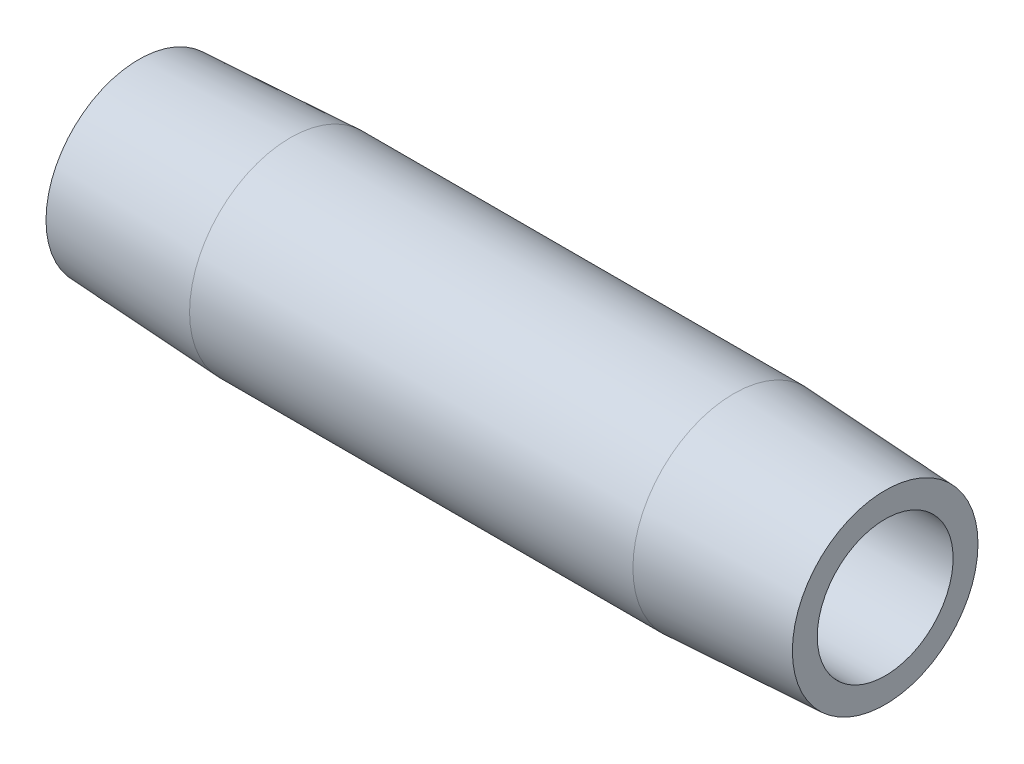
ISO-10303-21;
HEADER;
FILE_DESCRIPTION(('STEP AP214'),'2;1');
FILE_NAME('part.step','',(''),(''),'','','');
FILE_SCHEMA(('AUTOMOTIVE_DESIGN { 1 0 10303 214 1 1 1 1 }'));
ENDSEC;
DATA;
#1=APPLICATION_CONTEXT('core data for automotive mechanical design processes');
#2=APPLICATION_PROTOCOL_DEFINITION('international standard','automotive_design',2000,#1);
#3=PRODUCT_CONTEXT('',#1,'mechanical');
#4=PRODUCT('Part','Part','',(#3));
#5=PRODUCT_RELATED_PRODUCT_CATEGORY('part','',(#4));
#6=PRODUCT_DEFINITION_FORMATION('','',#4);
#7=PRODUCT_DEFINITION_CONTEXT('part definition',#1,'design');
#8=PRODUCT_DEFINITION('design','',#6,#7);
#9=PRODUCT_DEFINITION_SHAPE('','',#8);
#10=(LENGTH_UNIT() NAMED_UNIT(*) SI_UNIT(.MILLI.,.METRE.));
#11=(NAMED_UNIT(*) PLANE_ANGLE_UNIT() SI_UNIT($,.RADIAN.));
#12=(NAMED_UNIT(*) SI_UNIT($,.STERADIAN.) SOLID_ANGLE_UNIT());
#13=UNCERTAINTY_MEASURE_WITH_UNIT(LENGTH_MEASURE(1.E-05),#10,'distance_accuracy_value','');
#14=(GEOMETRIC_REPRESENTATION_CONTEXT(3) GLOBAL_UNCERTAINTY_ASSIGNED_CONTEXT((#13)) GLOBAL_UNIT_ASSIGNED_CONTEXT((#10,
#11,#12)) REPRESENTATION_CONTEXT('',''));
#15=CARTESIAN_POINT('',(0.,0.,0.));
#16=DIRECTION('',(0.,0.,1.));
#17=DIRECTION('',(1.,0.,0.));
#18=AXIS2_PLACEMENT_3D('',#15,#16,#17);
#19=CARTESIAN_POINT('',(50.8000000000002,0.,-4.62277681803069));
#20=DIRECTION('',(-1.,0.,0.));
#21=DIRECTION('',(0.,0.,1.));
#22=AXIS2_PLACEMENT_3D('',#19,#20,#21);
#23=PLANE('',#22);
#24=CARTESIAN_POINT('',(50.8000000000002,0.,0.));
#25=DIRECTION('',(-1.,0.,0.));
#26=DIRECTION('',(0.,0.,1.));
#27=AXIS2_PLACEMENT_3D('',#24,#25,#26);
#28=CIRCLE('',#27,6.31752683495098);
#29=CARTESIAN_POINT('',(50.8000000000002,0.,6.31752683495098));
#30=VERTEX_POINT('',#29);
#31=EDGE_CURVE('E10',#30,#30,#28,.T.);
#32=ORIENTED_EDGE('',*,*,#31,.F.);
#33=EDGE_LOOP('',(#32));
#34=FACE_BOUND('',#33,.T.);
#35=CARTESIAN_POINT('',(50.8000000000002,0.,0.));
#36=DIRECTION('',(-1.,0.,0.));
#37=DIRECTION('',(0.,0.,1.));
#38=AXIS2_PLACEMENT_3D('',#35,#36,#37);
#39=CIRCLE('',#38,4.62277681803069);
#40=CARTESIAN_POINT('',(50.8000000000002,0.,4.62277681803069));
#41=VERTEX_POINT('',#40);
#42=EDGE_CURVE('E52',#41,#41,#39,.T.);
#43=ORIENTED_EDGE('',*,*,#42,.T.);
#44=EDGE_LOOP('',(#43));
#45=FACE_BOUND('',#44,.T.);
#46=ADVANCED_FACE('F30',(#34,#45),#23,.F.);
#47=CARTESIAN_POINT('',(50.8000000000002,0.,0.));
#48=DIRECTION('',(-1.,0.,0.));
#49=DIRECTION('',(0.,0.,1.));
#50=AXIS2_PLACEMENT_3D('',#47,#48,#49);
#51=CONICAL_SURFACE('',#50,6.31752683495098,0.0523598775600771);
#52=CARTESIAN_POINT('',(40.4876000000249,0.,0.));
#53=DIRECTION('',(-1.,0.,0.));
#54=DIRECTION('',(0.,0.,1.));
#55=AXIS2_PLACEMENT_3D('',#52,#53,#54);
#56=CIRCLE('',#55,6.85797681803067);
#57=CARTESIAN_POINT('',(40.4876000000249,0.,6.85797681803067));
#58=VERTEX_POINT('',#57);
#59=EDGE_CURVE('E36',#58,#58,#56,.T.);
#60=ORIENTED_EDGE('',*,*,#59,.F.);
#61=EDGE_LOOP('',(#60));
#62=FACE_BOUND('',#61,.T.);
#63=ORIENTED_EDGE('',*,*,#31,.T.);
#64=EDGE_LOOP('',(#63));
#65=FACE_BOUND('',#64,.T.);
#66=ADVANCED_FACE('F77',(#62,#65),#51,.T.);
#67=CARTESIAN_POINT('',(-6.37599469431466,0.,0.));
#68=DIRECTION('',(-1.,0.,0.));
#69=DIRECTION('',(0.,0.,1.));
#70=AXIS2_PLACEMENT_3D('',#67,#68,#69);
#71=CYLINDRICAL_SURFACE('',#70,6.85797681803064);
#72=CARTESIAN_POINT('',(10.3123999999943,0.,0.));
#73=DIRECTION('',(-1.,0.,0.));
#74=DIRECTION('',(0.,0.,1.));
#75=AXIS2_PLACEMENT_3D('',#72,#73,#74);
#76=CIRCLE('',#75,6.8579768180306);
#77=CARTESIAN_POINT('',(10.3123999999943,0.,6.8579768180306));
#78=VERTEX_POINT('',#77);
#79=EDGE_CURVE('E40',#78,#78,#76,.T.);
#80=ORIENTED_EDGE('',*,*,#79,.F.);
#81=EDGE_LOOP('',(#80));
#82=FACE_BOUND('',#81,.T.);
#83=ORIENTED_EDGE('',*,*,#59,.T.);
#84=EDGE_LOOP('',(#83));
#85=FACE_BOUND('',#84,.T.);
#86=ADVANCED_FACE('F72',(#82,#85),#71,.T.);
#87=CARTESIAN_POINT('',(10.3123999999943,0.,0.));
#88=DIRECTION('',(1.,0.,0.));
#89=DIRECTION('',(0.,0.,-1.));
#90=AXIS2_PLACEMENT_3D('',#87,#88,#89);
#91=CONICAL_SURFACE('',#90,6.8579768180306,0.0523598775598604);
#92=CARTESIAN_POINT('',(1.90819582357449E-11,0.,0.));
#93=DIRECTION('',(-1.,0.,0.));
#94=DIRECTION('',(0.,0.,1.));
#95=AXIS2_PLACEMENT_3D('',#92,#93,#94);
#96=CIRCLE('',#95,6.31752683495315);
#97=CARTESIAN_POINT('',(1.90819582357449E-11,0.,6.31752683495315));
#98=VERTEX_POINT('',#97);
#99=EDGE_CURVE('E44',#98,#98,#96,.T.);
#100=ORIENTED_EDGE('',*,*,#99,.F.);
#101=EDGE_LOOP('',(#100));
#102=FACE_BOUND('',#101,.T.);
#103=ORIENTED_EDGE('',*,*,#79,.T.);
#104=EDGE_LOOP('',(#103));
#105=FACE_BOUND('',#104,.T.);
#106=ADVANCED_FACE('F66',(#102,#105),#91,.T.);
#107=CARTESIAN_POINT('',(1.90819582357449E-11,0.,-6.31752683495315));
#108=DIRECTION('',(1.,0.,0.));
#109=DIRECTION('',(0.,0.,-1.));
#110=AXIS2_PLACEMENT_3D('',#107,#108,#109);
#111=PLANE('',#110);
#112=CARTESIAN_POINT('',(1.90819582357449E-11,0.,0.));
#113=DIRECTION('',(-1.,0.,0.));
#114=DIRECTION('',(0.,0.,1.));
#115=AXIS2_PLACEMENT_3D('',#112,#113,#114);
#116=CIRCLE('',#115,4.62277681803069);
#117=CARTESIAN_POINT('',(1.90819582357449E-11,0.,4.62277681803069));
#118=VERTEX_POINT('',#117);
#119=EDGE_CURVE('E49',#118,#118,#116,.T.);
#120=ORIENTED_EDGE('',*,*,#119,.F.);
#121=EDGE_LOOP('',(#120));
#122=FACE_BOUND('',#121,.T.);
#123=ORIENTED_EDGE('',*,*,#99,.T.);
#124=EDGE_LOOP('',(#123));
#125=FACE_BOUND('',#124,.T.);
#126=ADVANCED_FACE('F60',(#122,#125),#111,.F.);
#127=CARTESIAN_POINT('',(-6.37599469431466,0.,0.));
#128=DIRECTION('',(-1.,0.,0.));
#129=DIRECTION('',(0.,0.,1.));
#130=AXIS2_PLACEMENT_3D('',#127,#128,#129);
#131=CYLINDRICAL_SURFACE('',#130,4.62277681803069);
#132=ORIENTED_EDGE('',*,*,#42,.F.);
#133=EDGE_LOOP('',(#132));
#134=FACE_BOUND('',#133,.T.);
#135=ORIENTED_EDGE('',*,*,#119,.T.);
#136=EDGE_LOOP('',(#135));
#137=FACE_BOUND('',#136,.T.);
#138=ADVANCED_FACE('F57',(#134,#137),#131,.F.);
#139=CLOSED_SHELL('',(#46,#66,#86,#106,#126,#138));
#140=MANIFOLD_SOLID_BREP('B2',#139);
#141=ADVANCED_BREP_SHAPE_REPRESENTATION('',(#18,#140),#14);
#142=SHAPE_DEFINITION_REPRESENTATION(#9,#141);
ENDSEC;
END-ISO-10303-21;
